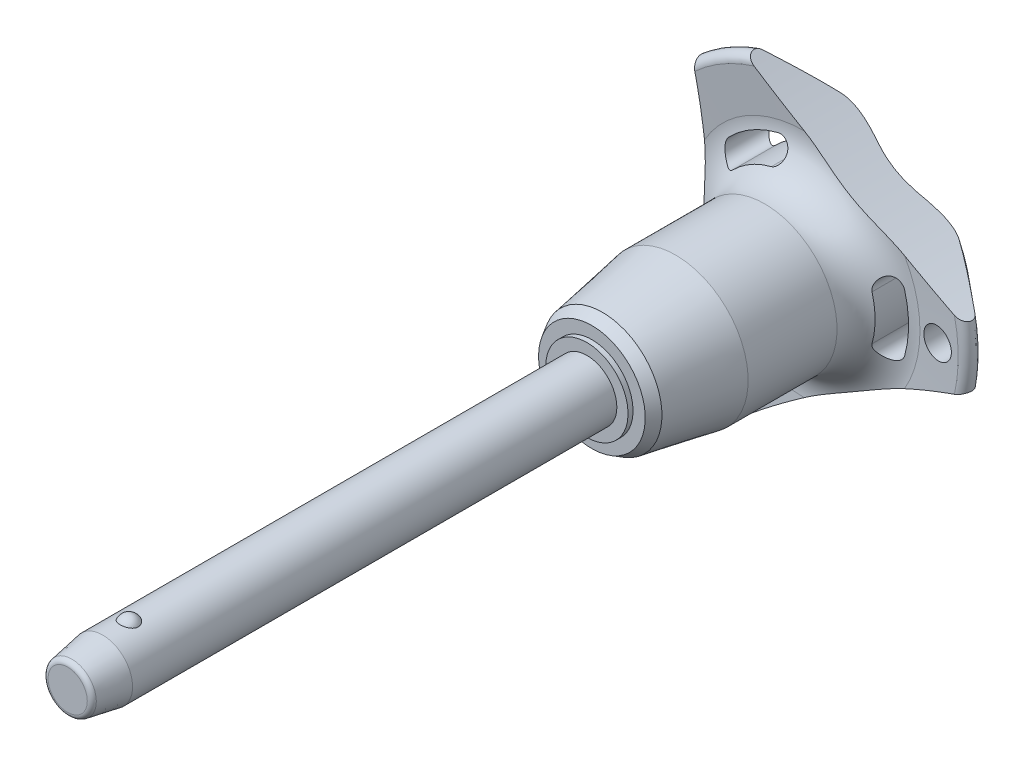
from build123d import *

# Parameters (mm, degrees)
SKETCH1_R           = 3
BOSS_EXTRUDE1_DEPTH = 45
SKETCH2_R           = 2.5
BOSS_EXTRUDE2_DEPTH = 26.7
BOSS_EXTRUDE3_START = 7
SKETCH1_2_R         = 3
BOSS_EXTRUDE3_DEPTH = 7
CHAMFER1_SIZE       = 3.5
CHAMFER1_SIZE2      = 0.617144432
FILLET1_R           = 0.5
SKETCH6_R           = 79.96
CUT_EXTRUDE1_DEPTH  = 76.446116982
CIRPATTERN1_COUNT   = 3
SKETCH7_R           = 1.5
CUT_EXTRUDE2_DEPTH  = 76.244100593


with BuildPart() as part:
    # Sketch1 → Boss-Extrude1 (new body)
    with BuildSketch(Plane.XY):
        Circle(SKETCH1_R)
    extrude(amount=-BOSS_EXTRUDE1_DEPTH)

    # Sketch2 → Boss-Extrude2 (add)
    with BuildSketch(Plane(origin=(0, 0, -45), x_dir=(-1, 0, 0), z_dir=(0, 0, -1))):
        Circle(SKETCH2_R)
    extrude(amount=BOSS_EXTRUDE2_DEPTH)

    # Sketch3 → Revolve1 (revolve)
    with BuildSketch(Plane(origin=(0, 0, 0), x_dir=(0, 0, -1), z_dir=(1, 0, 0))):
        with BuildLine():
            Line((-0.866025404, 3.5), (-0.866025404, 1.5))
            ThreePointArc((-0.866025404, 1.5), (0.133974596, 2.5), (-0.866025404, 3.5))
        make_face()
        with BuildLine():
            Line((-0.866025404, -1.5), (-0.866025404, -3.5))
            ThreePointArc((-0.866025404, -3.5), (0.133974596, -2.5), (-0.866025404, -1.5))
        make_face()
    revolve(axis=Axis((0, -1.5, 0.866025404), (0, 1, 0)))

    # Sketch1_2 → Boss-Extrude3 (add)
    with BuildSketch(Plane.XY.offset(BOSS_EXTRUDE3_START)):
        Circle(SKETCH1_2_R)
    extrude(amount=-BOSS_EXTRUDE3_DEPTH)

    # Chamfer1
    chamfer1_edges = [part.edges().sort_by_distance(p)[0] for p in [
        (-3, 0, 7),
    ]]
    chamfer1_side = [part.faces().sort_by_distance(p)[0] for p in [
        (-3, 0, -19),
    ]]
    chamfer(chamfer1_edges, length=CHAMFER1_SIZE, length2=CHAMFER1_SIZE2, reference=chamfer1_side[0])

    # Fillet1
    fillet1_edges = [part.edges().sort_by_distance(p)[0] for p in [
        (-2.382855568, 0, 7),
        (2.5, 0, -71.7),
    ]]
    fillet(fillet1_edges, radius=FILLET1_R)

    # Sketch4 → Revolve2 (revolve)
    with BuildSketch(Plane(origin=(0, 0, 0), x_dir=(0, 0, -1), z_dir=(1, 0, 0)), mode=Mode.PRIVATE) as revolve2_sk:
        Polygon((45, 0), (45, 4.118359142), (45.5, 4.118359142), (45.5, 5.343400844), (46.560917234, 5.955921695), (53.9, 7.25), (62.8, 7.25), (62.8, 0), align=None)
    revolve(revolve2_sk.sketch.rotate(Axis((0, 0, -62.8), (0, 0, 1)), 90), axis=Axis((0, 0, -62.8), (0, 0, 1)))

    # Sketch5 → Revolve3 (revolve)
    with BuildSketch(Plane(origin=(0, 0, 0), x_dir=(0, 0, -1), z_dir=(1, 0, 0)), mode=Mode.PRIVATE) as revolve3_sk:
        with BuildLine():
            Line((66.78715932, 11.570250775), (66.452568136, 15.735949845))
            ThreePointArc((66.452568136, 15.735949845), (66.946485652, 16.540188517), (67.862835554, 16.314230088))
            Line((67.862835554, 16.314230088), (71.326414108, 12.186497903))
            ThreePointArc((71.326414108, 12.186497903), (71.7, 11.109282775), (71.261488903, 10.056825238))
            ThreePointArc((71.261488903, 10.056825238), (68.289873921, 5.413681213), (67.25, 0))
            Line((67.25, 0), (62.8, 0))
            Line((62.8, 0), (62.8, 7.25))
            ThreePointArc((62.8, 7.25), (65.739473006, 8.537160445), (66.78715932, 11.570250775))
        make_face()
    revolve(revolve3_sk.sketch.rotate(Axis((0, 0, -67.25), (0, 0, 1)), 90), axis=Axis((0, 0, -67.25), (0, 0, 1)))

    # Sketch6 → Cut-Extrude1 (cut, through all)
    with BuildSketch(Plane.XY):
        with Locations((-89.76, 0)):
            Circle(SKETCH6_R)
        with BuildLine():
            ThreePointArc((10.099921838, -2.834717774), (10.490188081, 0), (10.099921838, 2.834717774))
            ThreePointArc((10.099921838, 2.834717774), (8.768180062, 3.582738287), (8.020159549, 2.250996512))
            ThreePointArc((8.020159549, 2.250996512), (8.330062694, 0), (8.020159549, -2.250996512))
            ThreePointArc((8.020159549, -2.250996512), (8.768180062, -3.582738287), (10.099921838, -2.834717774))
        make_face()
    cut_extrude1 = extrude(amount=-CUT_EXTRUDE1_DEPTH, mode=Mode.SUBTRACT)

    # CirPattern1: Cut-Extrude1 ×3 about axis
    cirpattern1_axis = Axis((0, 0, 0), (0, 0, 1))
    for i in range(1, CIRPATTERN1_COUNT):
        add(cut_extrude1.rotate(cirpattern1_axis, i * 360 / CIRPATTERN1_COUNT), mode=Mode.SUBTRACT)

    # Sketch7 → Cut-Extrude2 (cut, through all)
    with BuildSketch(Plane.XY):
        with Locations(Location((13.490188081, 0, 0), (0, 0, 225.221865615))):
            Circle(SKETCH7_R)
    extrude(amount=-CUT_EXTRUDE2_DEPTH, mode=Mode.SUBTRACT)


solid = part.part
